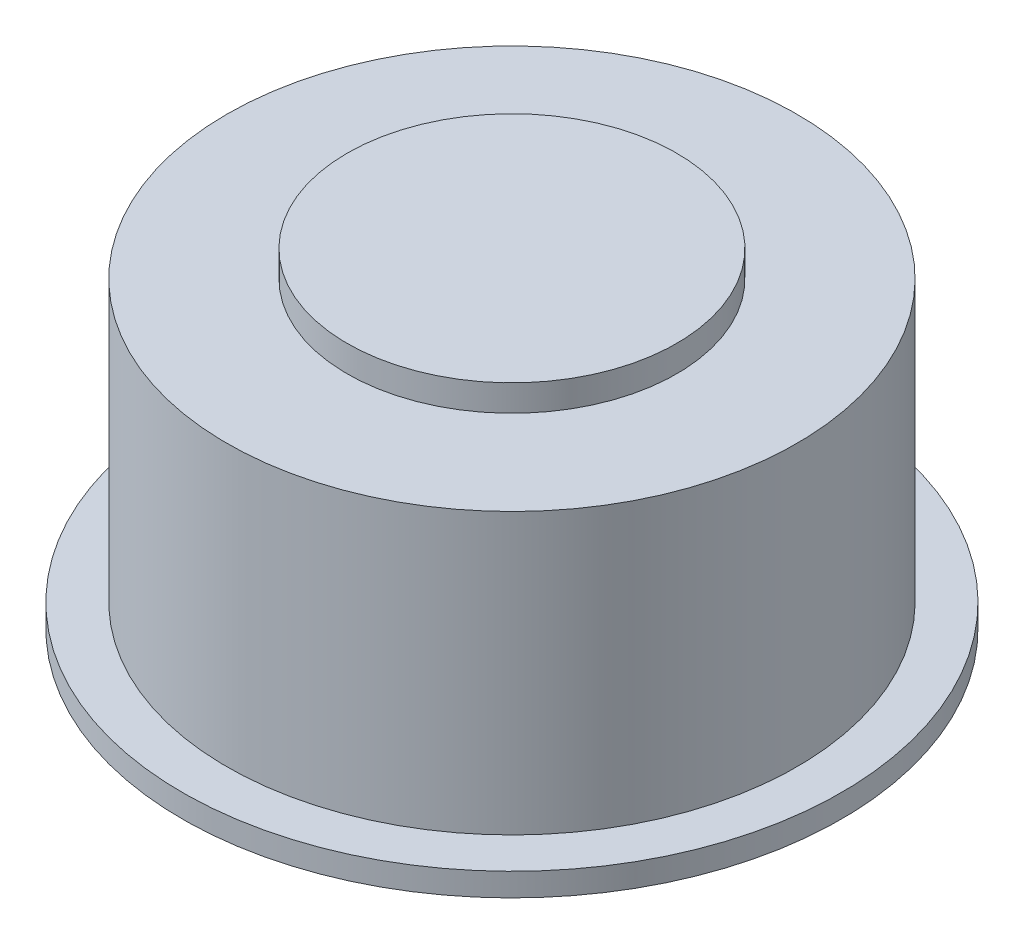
from build123d import *


with BuildPart() as part:
    # Sketch1 → Revolve1 (revolve)
    with BuildSketch(Plane.XY, mode=Mode.PRIVATE) as revolve1_sk:
        Polygon((0, 0), (100, 0), (100, 7), (86.5, 7), (86.5, 92), (50, 92), (50, 100), (0, 100), align=None)
    revolve(revolve1_sk.sketch.rotate(Axis((0, 100, 0), (0, -1, 0)), 180), axis=Axis((0, 100, 0), (0, -1, 0)))


solid = part.part
